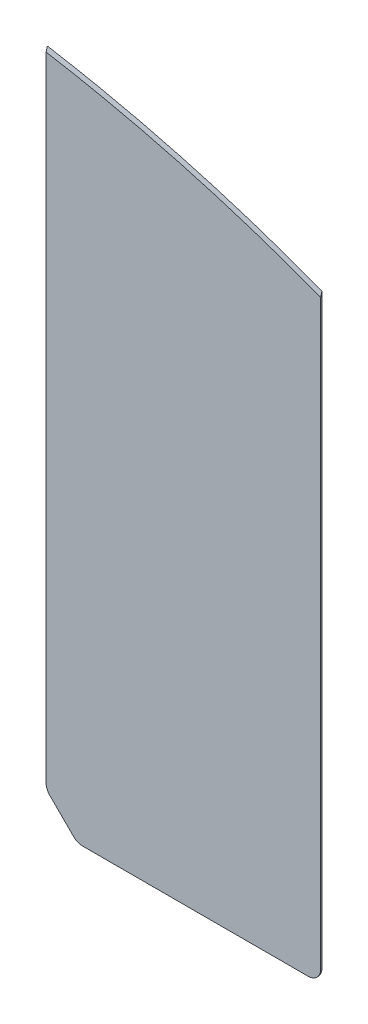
ISO-10303-21;
HEADER;
FILE_DESCRIPTION(('STEP AP214'),'2;1');
FILE_NAME('part.step','',(''),(''),'','','');
FILE_SCHEMA(('AUTOMOTIVE_DESIGN { 1 0 10303 214 1 1 1 1 }'));
ENDSEC;
DATA;
#1=APPLICATION_CONTEXT('core data for automotive mechanical design processes');
#2=APPLICATION_PROTOCOL_DEFINITION('international standard','automotive_design',2000,#1);
#3=PRODUCT_CONTEXT('',#1,'mechanical');
#4=PRODUCT('Part','Part','',(#3));
#5=PRODUCT_RELATED_PRODUCT_CATEGORY('part','',(#4));
#6=PRODUCT_DEFINITION_FORMATION('','',#4);
#7=PRODUCT_DEFINITION_CONTEXT('part definition',#1,'design');
#8=PRODUCT_DEFINITION('design','',#6,#7);
#9=PRODUCT_DEFINITION_SHAPE('','',#8);
#10=(LENGTH_UNIT() NAMED_UNIT(*) SI_UNIT(.MILLI.,.METRE.));
#11=(NAMED_UNIT(*) PLANE_ANGLE_UNIT() SI_UNIT($,.RADIAN.));
#12=(NAMED_UNIT(*) SI_UNIT($,.STERADIAN.) SOLID_ANGLE_UNIT());
#13=UNCERTAINTY_MEASURE_WITH_UNIT(LENGTH_MEASURE(1.E-05),#10,'distance_accuracy_value','');
#14=(GEOMETRIC_REPRESENTATION_CONTEXT(3) GLOBAL_UNCERTAINTY_ASSIGNED_CONTEXT((#13)) GLOBAL_UNIT_ASSIGNED_CONTEXT((#10,
#11,#12)) REPRESENTATION_CONTEXT('',''));
#15=CARTESIAN_POINT('',(0.,0.,0.));
#16=DIRECTION('',(0.,0.,1.));
#17=DIRECTION('',(1.,0.,0.));
#18=AXIS2_PLACEMENT_3D('',#15,#16,#17);
#19=CARTESIAN_POINT('',(44.,96.,0.2));
#20=DIRECTION('',(-1.,0.,0.));
#21=DIRECTION('',(0.,0.,1.));
#22=AXIS2_PLACEMENT_3D('',#19,#20,#21);
#23=PLANE('',#22);
#24=DIRECTION('',(0.,1.,0.));
#25=VECTOR('',#24,1.);
#26=CARTESIAN_POINT('',(44.,96.,0.2));
#27=LINE('',#26,#25);
#28=CARTESIAN_POINT('',(44.,2.,0.2));
#29=VERTEX_POINT('',#28);
#30=CARTESIAN_POINT('',(44.,95.2116685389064,0.2));
#31=VERTEX_POINT('',#30);
#32=EDGE_CURVE('E129',#29,#31,#27,.T.);
#33=ORIENTED_EDGE('',*,*,#32,.F.);
#34=DIRECTION('',(0.,0.,-1.));
#35=VECTOR('',#34,1.);
#36=CARTESIAN_POINT('',(44.,2.,0.2));
#37=LINE('',#36,#35);
#38=CARTESIAN_POINT('',(44.,2.,0.));
#39=VERTEX_POINT('',#38);
#40=EDGE_CURVE('E199',#29,#39,#37,.T.);
#41=ORIENTED_EDGE('',*,*,#40,.T.);
#42=DIRECTION('',(0.,1.,0.));
#43=VECTOR('',#42,1.);
#44=CARTESIAN_POINT('',(44.,96.,0.));
#45=LINE('',#44,#43);
#46=CARTESIAN_POINT('',(44.0000000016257,95.9999448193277,0.));
#47=VERTEX_POINT('',#46);
#48=EDGE_CURVE('E115',#39,#47,#45,.T.);
#49=ORIENTED_EDGE('',*,*,#48,.T.);
#50=CARTESIAN_POINT('',(44.0000000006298,95.2116685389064,0.2));
#51=CARTESIAN_POINT('',(44.0000000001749,95.3430402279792,0.166672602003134));
#52=CARTESIAN_POINT('',(44.000000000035,95.4744111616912,0.133342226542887));
#53=CARTESIAN_POINT('',(43.9999999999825,95.6714664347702,0.0833422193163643));
#54=CARTESIAN_POINT('',(43.9999999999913,95.7371513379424,0.0666748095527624));
#55=CARTESIAN_POINT('',(44.0000000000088,95.868520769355,0.03333851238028));
#56=CARTESIAN_POINT('',(44.0000000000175,95.9342052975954,0.0166696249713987));
#57=CARTESIAN_POINT('',(44.,95.999889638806,5.93240395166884E-10));
#58=B_SPLINE_CURVE_WITH_KNOTS('',3,(#50,#51,#52,#53,#54,#55,#56,#57),.UNSPECIFIED.,.F.,.F.,(4,2,
2,4),(0.,0.406599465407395,0.609899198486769,0.81319893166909),.UNSPECIFIED.);
#59=EDGE_CURVE('E111',#31,#47,#58,.T.);
#60=ORIENTED_EDGE('',*,*,#59,.F.);
#61=EDGE_LOOP('',(#33,#41,#49,#60));
#62=FACE_BOUND('',#61,.T.);
#63=ADVANCED_FACE('F35',(#62),#23,.F.);
#64=CARTESIAN_POINT('',(0.,0.,0.2));
#65=DIRECTION('',(1.,0.,0.));
#66=DIRECTION('',(0.,1.,0.));
#67=AXIS2_PLACEMENT_3D('',#64,#65,#66);
#68=PLANE('',#67);
#69=DIRECTION('',(0.,-1.,0.));
#70=VECTOR('',#69,1.);
#71=CARTESIAN_POINT('',(0.,0.,0.));
#72=LINE('',#71,#70);
#73=CARTESIAN_POINT('',(-3.06603864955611E-09,108.000000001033,0.));
#74=VERTEX_POINT('',#73);
#75=CARTESIAN_POINT('',(0.,5.82842712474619,0.));
#76=VERTEX_POINT('',#75);
#77=EDGE_CURVE('E114',#74,#76,#72,.T.);
#78=ORIENTED_EDGE('',*,*,#77,.T.);
#79=DIRECTION('',(0.,0.,1.));
#80=VECTOR('',#79,1.);
#81=CARTESIAN_POINT('',(0.,5.82842712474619,0.2));
#82=LINE('',#81,#80);
#83=CARTESIAN_POINT('',(0.,5.82842712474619,0.2));
#84=VERTEX_POINT('',#83);
#85=EDGE_CURVE('E11',#76,#84,#82,.T.);
#86=ORIENTED_EDGE('',*,*,#85,.T.);
#87=DIRECTION('',(0.,-1.,0.));
#88=VECTOR('',#87,1.);
#89=CARTESIAN_POINT('',(0.,0.,0.2));
#90=LINE('',#89,#88);
#91=CARTESIAN_POINT('',(0.,107.253589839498,0.2));
#92=VERTEX_POINT('',#91);
#93=EDGE_CURVE('E123',#92,#84,#90,.T.);
#94=ORIENTED_EDGE('',*,*,#93,.F.);
#95=CARTESIAN_POINT('',(-3.06603864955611E-09,108.000000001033,0.));
#96=CARTESIAN_POINT('',(-1.27737728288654E-09,107.937765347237,0.0166757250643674));
#97=CARTESIAN_POINT('',(-3.83185456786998E-10,107.875530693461,0.0333514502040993));
#98=CARTESIAN_POINT('',(3.83185348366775E-10,107.751061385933,0.0667029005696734));
#99=CARTESIAN_POINT('',(2.55364327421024E-10,107.68882673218,0.0833786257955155));
#100=CARTESIAN_POINT('',(-5.10173781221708E-10,107.502257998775,0.133369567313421));
#101=CARTESIAN_POINT('',(-1.52941285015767E-09,107.377923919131,0.166684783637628));
#102=CARTESIAN_POINT('',(0.,107.25358983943,0.199999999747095));
#103=B_SPLINE_CURVE_WITH_KNOTS('',3,(#95,#96,#97,#98,#99,#100,#101,#102),.UNSPECIFIED.,.F.,.F.,
(4,2,2,4),(0.,0.193290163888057,0.386580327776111,0.772740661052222),.UNSPECIFIED.);
#104=EDGE_CURVE('E108',#74,#92,#103,.T.);
#105=ORIENTED_EDGE('',*,*,#104,.F.);
#106=EDGE_LOOP('',(#78,#86,#94,#105));
#107=FACE_BOUND('',#106,.T.);
#108=ADVANCED_FACE('F120',(#107),#68,.F.);
#109=CARTESIAN_POINT('',(44.,0.,0.2));
#110=DIRECTION('',(0.,1.,0.));
#111=DIRECTION('',(0.,0.,1.));
#112=AXIS2_PLACEMENT_3D('',#109,#110,#111);
#113=PLANE('',#112);
#114=DIRECTION('',(1.,0.,0.));
#115=VECTOR('',#114,1.);
#116=CARTESIAN_POINT('',(44.,0.,0.2));
#117=LINE('',#116,#115);
#118=CARTESIAN_POINT('',(5.82842712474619,0.,0.2));
#119=VERTEX_POINT('',#118);
#120=CARTESIAN_POINT('',(42.,0.,0.2));
#121=VERTEX_POINT('',#120);
#122=EDGE_CURVE('E127',#119,#121,#117,.T.);
#123=ORIENTED_EDGE('',*,*,#122,.F.);
#124=DIRECTION('',(0.,0.,1.));
#125=VECTOR('',#124,1.);
#126=CARTESIAN_POINT('',(5.82842712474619,0.,0.2));
#127=LINE('',#126,#125);
#128=CARTESIAN_POINT('',(5.82842712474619,0.,0.));
#129=VERTEX_POINT('',#128);
#130=EDGE_CURVE('E58',#119,#129,#127,.F.);
#131=ORIENTED_EDGE('',*,*,#130,.T.);
#132=DIRECTION('',(1.,0.,0.));
#133=VECTOR('',#132,1.);
#134=CARTESIAN_POINT('',(44.,0.,0.));
#135=LINE('',#134,#133);
#136=CARTESIAN_POINT('',(42.,0.,0.));
#137=VERTEX_POINT('',#136);
#138=EDGE_CURVE('E207',#129,#137,#135,.T.);
#139=ORIENTED_EDGE('',*,*,#138,.T.);
#140=DIRECTION('',(0.,0.,-1.));
#141=VECTOR('',#140,1.);
#142=CARTESIAN_POINT('',(42.,0.,0.2));
#143=LINE('',#142,#141);
#144=EDGE_CURVE('E139',#137,#121,#143,.F.);
#145=ORIENTED_EDGE('',*,*,#144,.T.);
#146=EDGE_LOOP('',(#123,#131,#139,#145));
#147=FACE_BOUND('',#146,.T.);
#148=ADVANCED_FACE('F161',(#147),#113,.F.);
#149=CARTESIAN_POINT('',(-38.2188317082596,-118.802382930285,0.2));
#150=DIRECTION('',(0.,0.,-1.));
#151=DIRECTION('',(-1.,0.,0.));
#152=AXIS2_PLACEMENT_3D('',#149,#150,#151);
#153=PLANE('',#152);
#154=DIRECTION('',(-0.707106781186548,0.707106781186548,0.));
#155=VECTOR('',#154,1.);
#156=CARTESIAN_POINT('',(0.,5.,0.2));
#157=LINE('',#156,#155);
#158=CARTESIAN_POINT('',(4.4142135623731,0.585786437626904,0.2));
#159=VERTEX_POINT('',#158);
#160=CARTESIAN_POINT('',(0.585786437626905,4.41421356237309,0.2));
#161=VERTEX_POINT('',#160);
#162=EDGE_CURVE('E305',#159,#161,#157,.T.);
#163=ORIENTED_EDGE('',*,*,#162,.F.);
#164=CARTESIAN_POINT('',(5.82842712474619,2.,0.200000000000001));
#165=DIRECTION('',(0.,0.,-1.));
#166=DIRECTION('',(-1.,0.,0.));
#167=AXIS2_PLACEMENT_3D('',#164,#165,#166);
#168=CIRCLE('',#167,2.);
#169=EDGE_CURVE('E190',#159,#119,#168,.F.);
#170=ORIENTED_EDGE('',*,*,#169,.T.);
#171=ORIENTED_EDGE('',*,*,#122,.T.);
#172=CARTESIAN_POINT('',(42.,2.,0.2));
#173=DIRECTION('',(0.,0.,-1.));
#174=DIRECTION('',(-1.,0.,0.));
#175=AXIS2_PLACEMENT_3D('',#172,#173,#174);
#176=CIRCLE('',#175,2.);
#177=EDGE_CURVE('E202',#121,#29,#176,.F.);
#178=ORIENTED_EDGE('',*,*,#177,.T.);
#179=ORIENTED_EDGE('',*,*,#32,.T.);
#180=CARTESIAN_POINT('',(45.0021922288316,94.8241066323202,0.2));
#181=CARTESIAN_POINT('',(37.7522907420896,97.6472320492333,0.2));
#182=CARTESIAN_POINT('',(30.3427728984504,100.108824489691,0.2));
#183=CARTESIAN_POINT('',(15.306518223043,104.26231761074,0.2));
#184=CARTESIAN_POINT('',(7.67989080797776,105.955157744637,0.2));
#185=CARTESIAN_POINT('',(-0.332998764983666,107.30988963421,0.2));
#186=CARTESIAN_POINT('',(-0.66668590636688,107.365542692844,0.200000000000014));
#187=CARTESIAN_POINT('',(-1.00017550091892,107.42043367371,0.2));
#188=B_SPLINE_CURVE_WITH_KNOTS('',3,(#180,#181,#182,#183,#184,#185,#186,#187),.UNSPECIFIED.,.F.,
.F.,(4,2,2,4),(0.,0.48939006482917,0.978780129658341,1.),.UNSPECIFIED.);
#189=EDGE_CURVE('E124',#31,#92,#188,.T.);
#190=ORIENTED_EDGE('',*,*,#189,.T.);
#191=ORIENTED_EDGE('',*,*,#93,.T.);
#192=CARTESIAN_POINT('',(2.,5.82842712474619,0.2));
#193=DIRECTION('',(0.,0.,-1.));
#194=DIRECTION('',(-1.,0.,0.));
#195=AXIS2_PLACEMENT_3D('',#192,#193,#194);
#196=CIRCLE('',#195,2.);
#197=EDGE_CURVE('E192',#84,#161,#196,.F.);
#198=ORIENTED_EDGE('',*,*,#197,.T.);
#199=EDGE_LOOP('',(#163,#170,#171,#178,#179,#190,#191,#198));
#200=FACE_BOUND('',#199,.T.);
#201=ADVANCED_FACE('F157',(#200),#153,.F.);
#202=CARTESIAN_POINT('',(-38.2188317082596,-118.802382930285,0.));
#203=DIRECTION('',(0.,0.,-1.));
#204=DIRECTION('',(-1.,0.,0.));
#205=AXIS2_PLACEMENT_3D('',#202,#203,#204);
#206=PLANE('',#205);
#207=ORIENTED_EDGE('',*,*,#138,.F.);
#208=CARTESIAN_POINT('',(5.82842712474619,2.,0.));
#209=DIRECTION('',(0.,0.,-1.));
#210=DIRECTION('',(-1.,0.,0.));
#211=AXIS2_PLACEMENT_3D('',#208,#209,#210);
#212=CIRCLE('',#211,2.);
#213=CARTESIAN_POINT('',(4.41421356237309,0.585786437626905,0.));
#214=VERTEX_POINT('',#213);
#215=EDGE_CURVE('E43',#129,#214,#212,.T.);
#216=ORIENTED_EDGE('',*,*,#215,.T.);
#217=DIRECTION('',(0.707106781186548,-0.707106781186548,0.));
#218=VECTOR('',#217,1.);
#219=CARTESIAN_POINT('',(42.7917756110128,-37.7917756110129,0.));
#220=LINE('',#219,#218);
#221=CARTESIAN_POINT('',(0.585786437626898,4.41421356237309,0.));
#222=VERTEX_POINT('',#221);
#223=EDGE_CURVE('E197',#222,#214,#220,.T.);
#224=ORIENTED_EDGE('',*,*,#223,.F.);
#225=CARTESIAN_POINT('',(2.,5.82842712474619,0.));
#226=DIRECTION('',(0.,0.,-1.));
#227=DIRECTION('',(-1.,0.,0.));
#228=AXIS2_PLACEMENT_3D('',#225,#226,#227);
#229=CIRCLE('',#228,2.);
#230=EDGE_CURVE('E50',#222,#76,#229,.T.);
#231=ORIENTED_EDGE('',*,*,#230,.T.);
#232=ORIENTED_EDGE('',*,*,#77,.F.);
#233=CARTESIAN_POINT('',(45.1532994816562,95.555061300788,0.));
#234=CARTESIAN_POINT('',(37.8786929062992,98.3832897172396,0.));
#235=CARTESIAN_POINT('',(30.4441416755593,100.848758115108,0.));
#236=CARTESIAN_POINT('',(15.3571904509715,105.007441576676,0.));
#237=CARTESIAN_POINT('',(7.70529811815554,106.701567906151,0.));
#238=CARTESIAN_POINT('',(-0.334100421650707,108.056299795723,0.));
#239=CARTESIAN_POINT('',(-0.668861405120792,108.111950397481,0.));
#240=CARTESIAN_POINT('',(-1.00340678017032,108.166836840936,0.));
#241=B_SPLINE_CURVE_WITH_KNOTS('',3,(#233,#234,#235,#236,#237,#238,#239,#240),.UNSPECIFIED.,.F.,
.F.,(4,2,2,4),(0.,0.48939006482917,0.978780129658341,1.),.UNSPECIFIED.);
#242=EDGE_CURVE('E103',#47,#74,#241,.T.);
#243=ORIENTED_EDGE('',*,*,#242,.F.);
#244=ORIENTED_EDGE('',*,*,#48,.F.);
#245=CARTESIAN_POINT('',(42.,2.,0.));
#246=DIRECTION('',(0.,0.,-1.));
#247=DIRECTION('',(-1.,0.,0.));
#248=AXIS2_PLACEMENT_3D('',#245,#246,#247);
#249=CIRCLE('',#248,2.);
#250=EDGE_CURVE('E204',#39,#137,#249,.T.);
#251=ORIENTED_EDGE('',*,*,#250,.T.);
#252=EDGE_LOOP('',(#207,#216,#224,#231,#232,#243,#244,#251));
#253=FACE_BOUND('',#252,.T.);
#254=ADVANCED_FACE('F126',(#253),#206,.T.);
#255=CARTESIAN_POINT('',(45.1532994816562,95.555061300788,0.));
#256=CARTESIAN_POINT('',(37.8786929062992,98.3832897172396,0.));
#257=CARTESIAN_POINT('',(30.4441416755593,100.848758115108,0.));
#258=CARTESIAN_POINT('',(15.3571904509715,105.007441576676,0.));
#259=CARTESIAN_POINT('',(7.70529811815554,106.701567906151,0.));
#260=CARTESIAN_POINT('',(-0.334100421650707,108.056299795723,0.));
#261=CARTESIAN_POINT('',(-0.668861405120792,108.111950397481,0.));
#262=CARTESIAN_POINT('',(-1.00340678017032,108.166836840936,0.));
#263=CARTESIAN_POINT('',(45.0021922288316,94.8241066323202,0.2));
#264=CARTESIAN_POINT('',(37.7522907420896,97.6472320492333,0.2));
#265=CARTESIAN_POINT('',(30.3427728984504,100.108824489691,0.2));
#266=CARTESIAN_POINT('',(15.306518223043,104.26231761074,0.2));
#267=CARTESIAN_POINT('',(7.67989080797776,105.955157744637,0.2));
#268=CARTESIAN_POINT('',(-0.332998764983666,107.30988963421,0.2));
#269=CARTESIAN_POINT('',(-0.66668590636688,107.365542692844,0.200000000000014));
#270=CARTESIAN_POINT('',(-1.00017550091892,107.42043367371,0.2));
#271=B_SPLINE_SURFACE_WITH_KNOTS('',1,3,((#255,#256,#257,#258,#259,#260,#261,#262),(#263,#264,
#265,#266,#267,#268,#269,#270)),.UNSPECIFIED.,.F.,.F.,.F.,(2,2),(4,2,2,4),(0.,1.),(0.,
0.48939006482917,0.978780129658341,1.),.UNSPECIFIED.);
#272=ORIENTED_EDGE('',*,*,#59,.T.);
#273=ORIENTED_EDGE('',*,*,#242,.T.);
#274=ORIENTED_EDGE('',*,*,#104,.T.);
#275=ORIENTED_EDGE('',*,*,#189,.F.);
#276=EDGE_LOOP('',(#272,#273,#274,#275));
#277=FACE_BOUND('',#276,.T.);
#278=ADVANCED_FACE('F106',(#277),#271,.F.);
#279=CARTESIAN_POINT('',(42.,2.,0.2));
#280=DIRECTION('',(0.,0.,-1.));
#281=DIRECTION('',(-1.,0.,0.));
#282=AXIS2_PLACEMENT_3D('',#279,#280,#281);
#283=CYLINDRICAL_SURFACE('',#282,2.);
#284=ORIENTED_EDGE('',*,*,#177,.F.);
#285=ORIENTED_EDGE('',*,*,#144,.F.);
#286=ORIENTED_EDGE('',*,*,#250,.F.);
#287=ORIENTED_EDGE('',*,*,#40,.F.);
#288=EDGE_LOOP('',(#284,#285,#286,#287));
#289=FACE_BOUND('',#288,.T.);
#290=ADVANCED_FACE('F167',(#289),#283,.T.);
#291=CARTESIAN_POINT('',(0.,5.,-9.8));
#292=DIRECTION('',(0.707106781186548,0.707106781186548,0.));
#293=DIRECTION('',(-0.707106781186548,0.707106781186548,0.));
#294=AXIS2_PLACEMENT_3D('',#291,#292,#293);
#295=PLANE('',#294);
#296=ORIENTED_EDGE('',*,*,#223,.T.);
#297=DIRECTION('',(0.,0.,1.));
#298=VECTOR('',#297,1.);
#299=CARTESIAN_POINT('',(4.41421356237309,0.585786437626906,-9.8));
#300=LINE('',#299,#298);
#301=EDGE_CURVE('E185',#214,#159,#300,.T.);
#302=ORIENTED_EDGE('',*,*,#301,.T.);
#303=ORIENTED_EDGE('',*,*,#162,.T.);
#304=DIRECTION('',(0.,0.,1.));
#305=VECTOR('',#304,1.);
#306=CARTESIAN_POINT('',(0.585786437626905,4.41421356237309,-9.8));
#307=LINE('',#306,#305);
#308=EDGE_CURVE('E195',#161,#222,#307,.F.);
#309=ORIENTED_EDGE('',*,*,#308,.T.);
#310=EDGE_LOOP('',(#296,#302,#303,#309));
#311=FACE_BOUND('',#310,.T.);
#312=ADVANCED_FACE('F169',(#311),#295,.F.);
#313=CARTESIAN_POINT('',(5.82842712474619,2.,-9.8));
#314=DIRECTION('',(0.,0.,1.));
#315=DIRECTION('',(1.,0.,0.));
#316=AXIS2_PLACEMENT_3D('',#313,#314,#315);
#317=CYLINDRICAL_SURFACE('',#316,2.);
#318=ORIENTED_EDGE('',*,*,#215,.F.);
#319=ORIENTED_EDGE('',*,*,#130,.F.);
#320=ORIENTED_EDGE('',*,*,#169,.F.);
#321=ORIENTED_EDGE('',*,*,#301,.F.);
#322=EDGE_LOOP('',(#318,#319,#320,#321));
#323=FACE_BOUND('',#322,.T.);
#324=ADVANCED_FACE('F171',(#323),#317,.T.);
#325=CARTESIAN_POINT('',(2.,5.82842712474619,0.2));
#326=DIRECTION('',(0.,0.,1.));
#327=DIRECTION('',(1.,0.,0.));
#328=AXIS2_PLACEMENT_3D('',#325,#326,#327);
#329=CYLINDRICAL_SURFACE('',#328,2.);
#330=ORIENTED_EDGE('',*,*,#230,.F.);
#331=ORIENTED_EDGE('',*,*,#308,.F.);
#332=ORIENTED_EDGE('',*,*,#197,.F.);
#333=ORIENTED_EDGE('',*,*,#85,.F.);
#334=EDGE_LOOP('',(#330,#331,#332,#333));
#335=FACE_BOUND('',#334,.T.);
#336=ADVANCED_FACE('F37',(#335),#329,.T.);
#337=CLOSED_SHELL('',(#63,#108,#148,#201,#254,#278,#290,#312,#324,#336));
#338=MANIFOLD_SOLID_BREP('B2',#337);
#339=ADVANCED_BREP_SHAPE_REPRESENTATION('',(#18,#338),#14);
#340=SHAPE_DEFINITION_REPRESENTATION(#9,#339);
ENDSEC;
END-ISO-10303-21;
